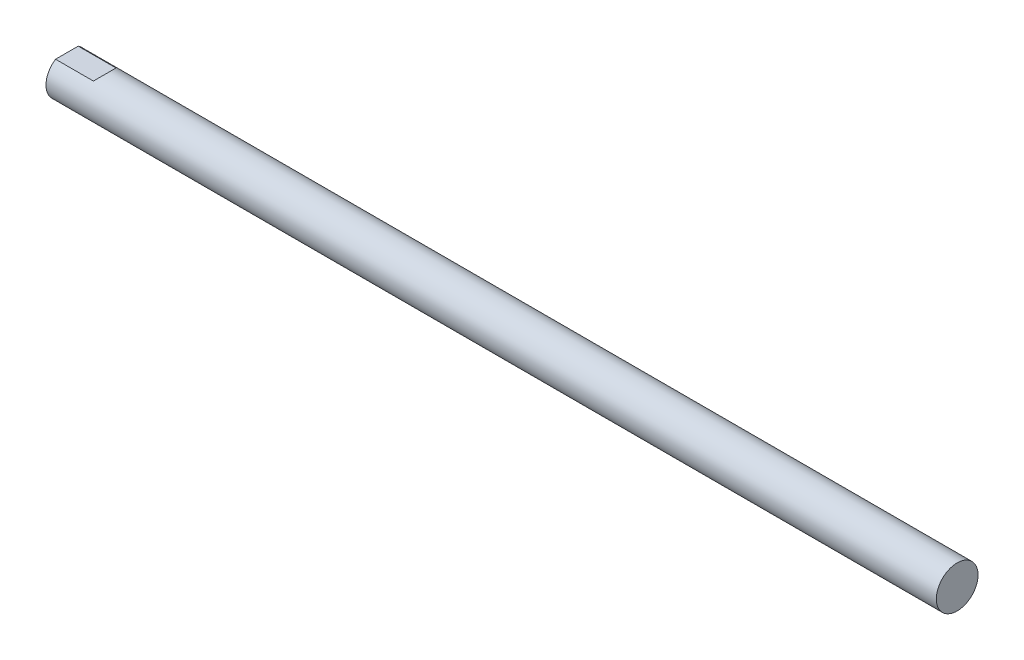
ISO-10303-21;
HEADER;
FILE_DESCRIPTION(('STEP AP214'),'2;1');
FILE_NAME('part.step','',(''),(''),'','','');
FILE_SCHEMA(('AUTOMOTIVE_DESIGN { 1 0 10303 214 1 1 1 1 }'));
ENDSEC;
DATA;
#1=APPLICATION_CONTEXT('core data for automotive mechanical design processes');
#2=APPLICATION_PROTOCOL_DEFINITION('international standard','automotive_design',2000,#1);
#3=PRODUCT_CONTEXT('',#1,'mechanical');
#4=PRODUCT('Part','Part','',(#3));
#5=PRODUCT_RELATED_PRODUCT_CATEGORY('part','',(#4));
#6=PRODUCT_DEFINITION_FORMATION('','',#4);
#7=PRODUCT_DEFINITION_CONTEXT('part definition',#1,'design');
#8=PRODUCT_DEFINITION('design','',#6,#7);
#9=PRODUCT_DEFINITION_SHAPE('','',#8);
#10=(LENGTH_UNIT() NAMED_UNIT(*) SI_UNIT(.MILLI.,.METRE.));
#11=(NAMED_UNIT(*) PLANE_ANGLE_UNIT() SI_UNIT($,.RADIAN.));
#12=(NAMED_UNIT(*) SI_UNIT($,.STERADIAN.) SOLID_ANGLE_UNIT());
#13=UNCERTAINTY_MEASURE_WITH_UNIT(LENGTH_MEASURE(1.E-05),#10,'distance_accuracy_value','');
#14=(GEOMETRIC_REPRESENTATION_CONTEXT(3) GLOBAL_UNCERTAINTY_ASSIGNED_CONTEXT((#13)) GLOBAL_UNIT_ASSIGNED_CONTEXT((#10,
#11,#12)) REPRESENTATION_CONTEXT('',''));
#15=CARTESIAN_POINT('',(0.,0.,0.));
#16=DIRECTION('',(0.,0.,1.));
#17=DIRECTION('',(1.,0.,0.));
#18=AXIS2_PLACEMENT_3D('',#15,#16,#17);
#19=CARTESIAN_POINT('',(0.,0.,0.));
#20=DIRECTION('',(1.,0.,0.));
#21=DIRECTION('',(0.,0.,-1.));
#22=AXIS2_PLACEMENT_3D('',#19,#20,#21);
#23=PLANE('',#22);
#24=CARTESIAN_POINT('',(0.,0.,0.));
#25=DIRECTION('',(-1.,0.,0.));
#26=DIRECTION('',(0.,0.,1.));
#27=AXIS2_PLACEMENT_3D('',#24,#25,#26);
#28=CIRCLE('',#27,3.96875);
#29=CARTESIAN_POINT('',(0.,0.,3.96875));
#30=VERTEX_POINT('',#29);
#31=EDGE_CURVE('E74',#30,#30,#28,.T.);
#32=ORIENTED_EDGE('',*,*,#31,.F.);
#33=EDGE_LOOP('',(#32));
#34=FACE_BOUND('',#33,.T.);
#35=CARTESIAN_POINT('',(0.,0.,0.));
#36=DIRECTION('',(-1.,0.,0.));
#37=DIRECTION('',(0.,0.,1.));
#38=AXIS2_PLACEMENT_3D('',#35,#36,#37);
#39=CIRCLE('',#38,9.525);
#40=CARTESIAN_POINT('',(0.,8.001,-5.16813544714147));
#41=VERTEX_POINT('',#40);
#42=CARTESIAN_POINT('',(0.,8.001,5.16813544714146));
#43=VERTEX_POINT('',#42);
#44=EDGE_CURVE('E86',#41,#43,#39,.T.);
#45=ORIENTED_EDGE('',*,*,#44,.T.);
#46=DIRECTION('',(0.,0.,1.));
#47=VECTOR('',#46,1.);
#48=CARTESIAN_POINT('',(0.,8.001,-9.525));
#49=LINE('',#48,#47);
#50=EDGE_CURVE('E72',#41,#43,#49,.T.);
#51=ORIENTED_EDGE('',*,*,#50,.F.);
#52=EDGE_LOOP('',(#45,#51));
#53=FACE_BOUND('',#52,.T.);
#54=ADVANCED_FACE('F36',(#34,#53),#23,.F.);
#55=CARTESIAN_POINT('',(-29.8621621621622,0.,0.));
#56=DIRECTION('',(-1.,0.,0.));
#57=DIRECTION('',(0.,0.,1.));
#58=AXIS2_PLACEMENT_3D('',#55,#56,#57);
#59=CYLINDRICAL_SURFACE('',#58,9.525);
#60=CARTESIAN_POINT('',(9.27099999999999,0.,0.));
#61=DIRECTION('',(0.707106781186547,-0.707106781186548,0.));
#62=DIRECTION('',(-0.707106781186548,-0.707106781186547,0.));
#63=AXIS2_PLACEMENT_3D('',#60,#61,#62);
#64=ELLIPSE('',#63,13.4703841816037,9.525);
#65=CARTESIAN_POINT('',(17.272,8.00099999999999,-5.16813544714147));
#66=VERTEX_POINT('',#65);
#67=CARTESIAN_POINT('',(17.272,8.001,5.16813544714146));
#68=VERTEX_POINT('',#67);
#69=EDGE_CURVE('E43',#66,#68,#64,.T.);
#70=ORIENTED_EDGE('',*,*,#69,.T.);
#71=DIRECTION('',(-1.,0.,0.));
#72=VECTOR('',#71,1.);
#73=CARTESIAN_POINT('',(-29.8621621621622,8.00099999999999,5.16813544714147));
#74=LINE('',#73,#72);
#75=EDGE_CURVE('E11',#68,#43,#74,.T.);
#76=ORIENTED_EDGE('',*,*,#75,.T.);
#77=ORIENTED_EDGE('',*,*,#44,.F.);
#78=DIRECTION('',(-1.,0.,0.));
#79=VECTOR('',#78,1.);
#80=CARTESIAN_POINT('',(-29.8621621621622,8.00099999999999,-5.16813544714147));
#81=LINE('',#80,#79);
#82=EDGE_CURVE('E68',#41,#66,#81,.F.);
#83=ORIENTED_EDGE('',*,*,#82,.T.);
#84=EDGE_LOOP('',(#70,#76,#77,#83));
#85=FACE_BOUND('',#84,.T.);
#86=CARTESIAN_POINT('',(406.4,0.,0.));
#87=DIRECTION('',(-1.,0.,0.));
#88=DIRECTION('',(0.,0.,1.));
#89=AXIS2_PLACEMENT_3D('',#86,#87,#88);
#90=CIRCLE('',#89,9.525);
#91=CARTESIAN_POINT('',(406.4,0.,9.525));
#92=VERTEX_POINT('',#91);
#93=EDGE_CURVE('E83',#92,#92,#90,.T.);
#94=ORIENTED_EDGE('',*,*,#93,.T.);
#95=EDGE_LOOP('',(#94));
#96=FACE_BOUND('',#95,.T.);
#97=ADVANCED_FACE('F64',(#85,#96),#59,.T.);
#98=CARTESIAN_POINT('',(406.4,9.525,0.));
#99=DIRECTION('',(-1.,0.,0.));
#100=DIRECTION('',(0.,0.,1.));
#101=AXIS2_PLACEMENT_3D('',#98,#99,#100);
#102=PLANE('',#101);
#103=ORIENTED_EDGE('',*,*,#93,.F.);
#104=EDGE_LOOP('',(#103));
#105=FACE_BOUND('',#104,.T.);
#106=ADVANCED_FACE('F94',(#105),#102,.F.);
#107=CARTESIAN_POINT('',(27.0002,0.,0.));
#108=DIRECTION('',(-1.,0.,0.));
#109=DIRECTION('',(0.,0.,1.));
#110=AXIS2_PLACEMENT_3D('',#107,#108,#109);
#111=CONICAL_SURFACE('',#110,3.96874999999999,1.02974425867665);
#112=CARTESIAN_POINT('',(29.3848655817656,0.,0.));
#113=VERTEX_POINT('',#112);
#114=VERTEX_LOOP('',#113);
#115=FACE_BOUND('',#114,.T.);
#116=CARTESIAN_POINT('',(27.0002,0.,0.));
#117=DIRECTION('',(-1.,0.,0.));
#118=DIRECTION('',(0.,0.,1.));
#119=AXIS2_PLACEMENT_3D('',#116,#117,#118);
#120=CIRCLE('',#119,3.96874999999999);
#121=CARTESIAN_POINT('',(27.0002,0.,3.96874999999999));
#122=VERTEX_POINT('',#121);
#123=EDGE_CURVE('E77',#122,#122,#120,.T.);
#124=ORIENTED_EDGE('',*,*,#123,.T.);
#125=EDGE_LOOP('',(#124));
#126=FACE_BOUND('',#125,.T.);
#127=ADVANCED_FACE('F99',(#115,#126),#111,.F.);
#128=CARTESIAN_POINT('',(0.,0.,0.));
#129=DIRECTION('',(-1.,0.,0.));
#130=DIRECTION('',(0.,0.,1.));
#131=AXIS2_PLACEMENT_3D('',#128,#129,#130);
#132=CYLINDRICAL_SURFACE('',#131,3.96875);
#133=ORIENTED_EDGE('',*,*,#123,.F.);
#134=EDGE_LOOP('',(#133));
#135=FACE_BOUND('',#134,.T.);
#136=ORIENTED_EDGE('',*,*,#31,.T.);
#137=EDGE_LOOP('',(#136));
#138=FACE_BOUND('',#137,.T.);
#139=ADVANCED_FACE('F97',(#135,#138),#132,.F.);
#140=CARTESIAN_POINT('',(17.272,8.001,-9.525));
#141=DIRECTION('',(0.707106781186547,-0.707106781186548,0.));
#142=DIRECTION('',(0.707106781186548,0.707106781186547,0.));
#143=AXIS2_PLACEMENT_3D('',#140,#141,#142);
#144=PLANE('',#143);
#145=DIRECTION('',(0.,0.,1.));
#146=VECTOR('',#145,1.);
#147=CARTESIAN_POINT('',(17.272,8.001,-9.525));
#148=LINE('',#147,#146);
#149=EDGE_CURVE('E50',#66,#68,#148,.T.);
#150=ORIENTED_EDGE('',*,*,#149,.T.);
#151=ORIENTED_EDGE('',*,*,#69,.F.);
#152=EDGE_LOOP('',(#150,#151));
#153=FACE_BOUND('',#152,.T.);
#154=ADVANCED_FACE('F73',(#153),#144,.F.);
#155=CARTESIAN_POINT('',(0.,8.001,-9.525));
#156=DIRECTION('',(0.,-1.,0.));
#157=DIRECTION('',(0.,0.,-1.));
#158=AXIS2_PLACEMENT_3D('',#155,#156,#157);
#159=PLANE('',#158);
#160=ORIENTED_EDGE('',*,*,#149,.F.);
#161=ORIENTED_EDGE('',*,*,#82,.F.);
#162=ORIENTED_EDGE('',*,*,#50,.T.);
#163=ORIENTED_EDGE('',*,*,#75,.F.);
#164=EDGE_LOOP('',(#160,#161,#162,#163));
#165=FACE_BOUND('',#164,.T.);
#166=ADVANCED_FACE('F70',(#165),#159,.F.);
#167=CLOSED_SHELL('',(#54,#97,#106,#127,#139,#154,#166));
#168=MANIFOLD_SOLID_BREP('B2',#167);
#169=ADVANCED_BREP_SHAPE_REPRESENTATION('',(#18,#168),#14);
#170=SHAPE_DEFINITION_REPRESENTATION(#9,#169);
ENDSEC;
END-ISO-10303-21;
